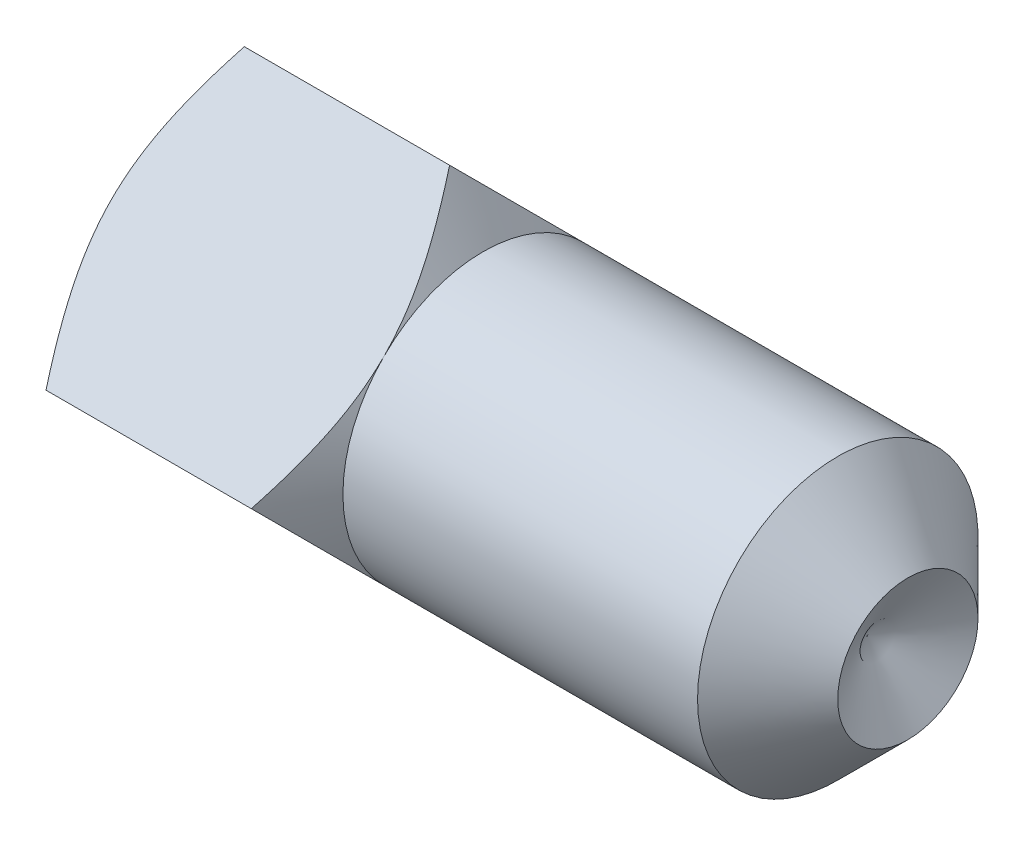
from build123d import *

# Parameters (mm, degrees)
BASEHEAD_DEPTH = 4
BODYSKE_W      = 6.53602765
BODYSKE_H      = 2


with BuildPart() as part:
    # BaseHeadSke → BaseHead (new body)
    with BuildSketch(Plane(origin=(0, 0, 0), x_dir=(0, 0, -1), z_dir=(1, 0, 0))):
        Polygon((0, 2.828427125), (2.828427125, 0), (0, -2.828427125), (-2.828427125, 0), align=None)
    extrude(amount=BASEHEAD_DEPTH)

    # HeadChamferSke → HeadChamfer (revolve, cut)
    with BuildSketch(Plane.XY, mode=Mode.PRIVATE) as headchamfer_sk:
        Polygon((0, 2.828427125), (0, 1.9), (0.53602765, 2.828427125), align=None)
        Polygon((3.46397235, 2.828427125), (4, 1.9), (4, 2.828427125), align=None)
    revolve(headchamfer_sk.sketch.rotate(Axis((0, 0, 0), (1, 0, 0)), 270), axis=Axis((0, 0, 0), (1, 0, 0)), mode=Mode.SUBTRACT)

    # BodySke → BaseBody (revolve)
    with BuildSketch(Plane.XY, mode=Mode.PRIVATE) as basebody_sk:
        with Locations((6.731986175, 1)):
            Rectangle(BODYSKE_W, BODYSKE_H)
    revolve(basebody_sk.sketch.rotate(Axis((0, 0, 0), (1, 0, 0)), 90), axis=Axis((0, 0, 0), (1, 0, 0)))

    # ChamferEndSke → ChamferEnd (revolve, cut)
    with BuildSketch(Plane.XY, mode=Mode.PRIVATE) as chamferend_sk:
        Polygon((10, 2), (10, 1), (9, 2), align=None)
    revolve(chamferend_sk.sketch.rotate(Axis((0, 0, 0), (1, 0, 0)), 90), axis=Axis((0, 0, 0), (1, 0, 0)), mode=Mode.SUBTRACT)

    # CupPointSke → CupPoint (revolve, cut)
    with BuildSketch(Plane.XY, mode=Mode.PRIVATE) as cuppoint_sk:
        Polygon((10, 1), (9.422649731, 0), (10, 0), align=None)
    revolve(cuppoint_sk.sketch.rotate(Axis((0, 0, 0), (1, 0, 0)), 270), axis=Axis((0, 0, 0), (1, 0, 0)), mode=Mode.SUBTRACT)


solid = part.part
